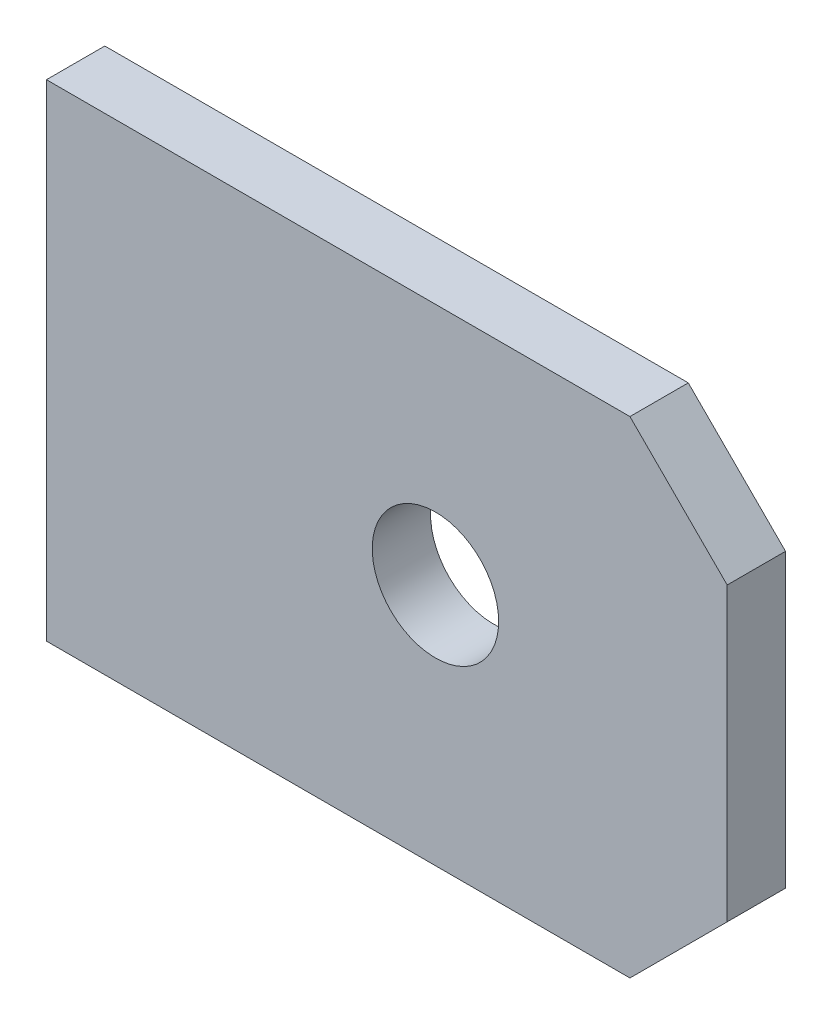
from build123d import *

# Parameters (mm, degrees)
ESQUISSE1_R          = 13
BASE_EXTRUSION_DEPTH = 12


with BuildPart() as part:
    # Esquisse1 → Base-Extrusion (new body)
    with BuildSketch(Plane.XY):
        Polygon((120, 0), (140, -20), (140, -80), (120, -100), (0, -100), (0, 0), align=None)
        with Locations((80, -50)):
            Circle(ESQUISSE1_R, mode=Mode.SUBTRACT)
    extrude(amount=BASE_EXTRUSION_DEPTH)


solid = part.part
